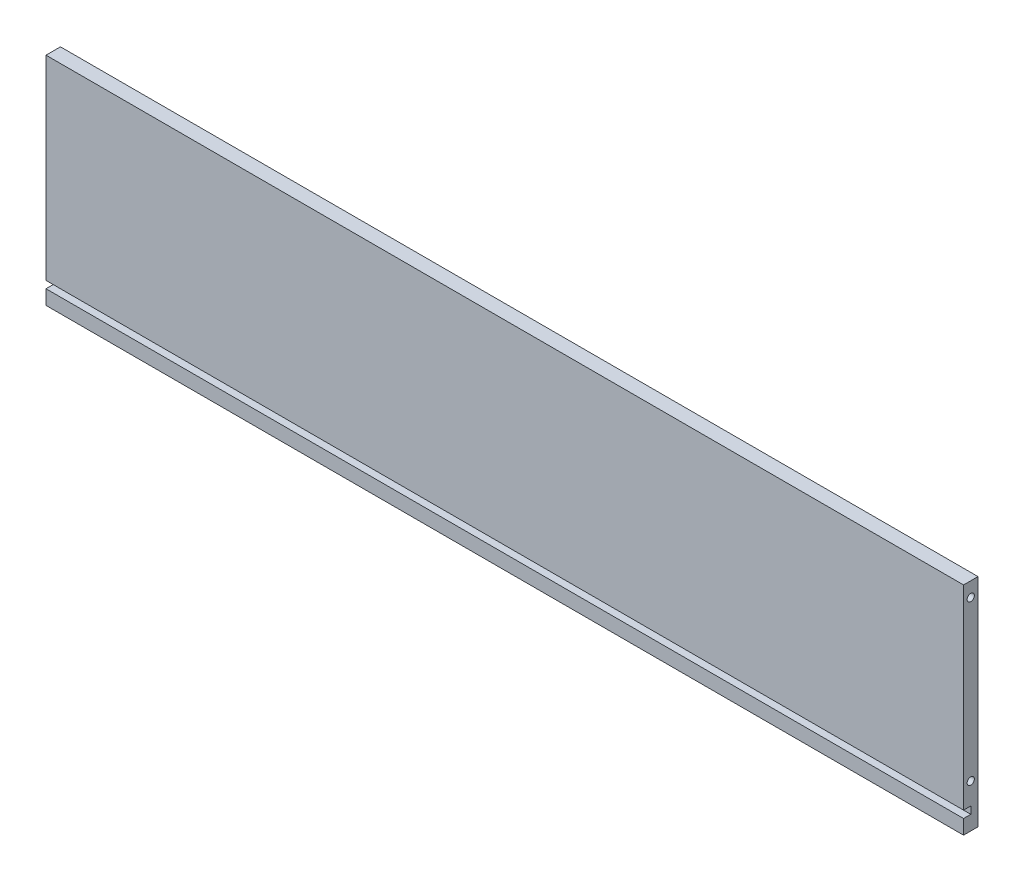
ISO-10303-21;
HEADER;
FILE_DESCRIPTION(('STEP AP214'),'2;1');
FILE_NAME('part.step','',(''),(''),'','','');
FILE_SCHEMA(('AUTOMOTIVE_DESIGN { 1 0 10303 214 1 1 1 1 }'));
ENDSEC;
DATA;
#1=APPLICATION_CONTEXT('core data for automotive mechanical design processes');
#2=APPLICATION_PROTOCOL_DEFINITION('international standard','automotive_design',2000,#1);
#3=PRODUCT_CONTEXT('',#1,'mechanical');
#4=PRODUCT('Part','Part','',(#3));
#5=PRODUCT_RELATED_PRODUCT_CATEGORY('part','',(#4));
#6=PRODUCT_DEFINITION_FORMATION('','',#4);
#7=PRODUCT_DEFINITION_CONTEXT('part definition',#1,'design');
#8=PRODUCT_DEFINITION('design','',#6,#7);
#9=PRODUCT_DEFINITION_SHAPE('','',#8);
#10=(LENGTH_UNIT() NAMED_UNIT(*) SI_UNIT(.MILLI.,.METRE.));
#11=(NAMED_UNIT(*) PLANE_ANGLE_UNIT() SI_UNIT($,.RADIAN.));
#12=(NAMED_UNIT(*) SI_UNIT($,.STERADIAN.) SOLID_ANGLE_UNIT());
#13=UNCERTAINTY_MEASURE_WITH_UNIT(LENGTH_MEASURE(1.E-05),#10,'distance_accuracy_value','');
#14=(GEOMETRIC_REPRESENTATION_CONTEXT(3) GLOBAL_UNCERTAINTY_ASSIGNED_CONTEXT((#13)) GLOBAL_UNIT_ASSIGNED_CONTEXT((#10,
#11,#12)) REPRESENTATION_CONTEXT('',''));
#15=CARTESIAN_POINT('',(0.,0.,0.));
#16=DIRECTION('',(0.,0.,1.));
#17=DIRECTION('',(1.,0.,0.));
#18=AXIS2_PLACEMENT_3D('',#15,#16,#17);
#19=CARTESIAN_POINT('',(-317.5,80.,10.));
#20=DIRECTION('',(0.,0.,-1.));
#21=DIRECTION('',(-1.,0.,0.));
#22=AXIS2_PLACEMENT_3D('',#19,#20,#21);
#23=PLANE('',#22);
#24=DIRECTION('',(0.,-1.,0.));
#25=VECTOR('',#24,1.);
#26=CARTESIAN_POINT('',(-317.5,-70.,10.));
#27=LINE('',#26,#25);
#28=CARTESIAN_POINT('',(-317.5,80.,10.));
#29=VERTEX_POINT('',#28);
#30=CARTESIAN_POINT('',(-317.5,-55.,10.));
#31=VERTEX_POINT('',#30);
#32=EDGE_CURVE('E170',#29,#31,#27,.T.);
#33=ORIENTED_EDGE('',*,*,#32,.T.);
#34=DIRECTION('',(1.,0.,0.));
#35=VECTOR('',#34,1.);
#36=CARTESIAN_POINT('',(-317.5,-55.,10.));
#37=LINE('',#36,#35);
#38=CARTESIAN_POINT('',(317.5,-55.,10.));
#39=VERTEX_POINT('',#38);
#40=EDGE_CURVE('E152',#31,#39,#37,.T.);
#41=ORIENTED_EDGE('',*,*,#40,.T.);
#42=DIRECTION('',(0.,1.,0.));
#43=VECTOR('',#42,1.);
#44=CARTESIAN_POINT('',(317.5,-70.,10.));
#45=LINE('',#44,#43);
#46=CARTESIAN_POINT('',(317.5,80.,10.));
#47=VERTEX_POINT('',#46);
#48=EDGE_CURVE('E174',#39,#47,#45,.T.);
#49=ORIENTED_EDGE('',*,*,#48,.T.);
#50=DIRECTION('',(-1.,0.,0.));
#51=VECTOR('',#50,1.);
#52=CARTESIAN_POINT('',(-317.5,80.,10.));
#53=LINE('',#52,#51);
#54=EDGE_CURVE('E51',#47,#29,#53,.T.);
#55=ORIENTED_EDGE('',*,*,#54,.T.);
#56=EDGE_LOOP('',(#33,#41,#49,#55));
#57=FACE_BOUND('',#56,.T.);
#58=ADVANCED_FACE('F28',(#57),#23,.F.);
#59=CARTESIAN_POINT('',(-317.5,-70.,10.));
#60=DIRECTION('',(1.,0.,0.));
#61=DIRECTION('',(0.,0.,-1.));
#62=AXIS2_PLACEMENT_3D('',#59,#60,#61);
#63=PLANE('',#62);
#64=CARTESIAN_POINT('',(-317.5,70.,4.99999999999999));
#65=DIRECTION('',(-1.,0.,0.));
#66=DIRECTION('',(0.,0.,1.));
#67=AXIS2_PLACEMENT_3D('',#64,#65,#66);
#68=CIRCLE('',#67,2.49999999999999);
#69=CARTESIAN_POINT('',(-317.5,70.,7.49999999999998));
#70=VERTEX_POINT('',#69);
#71=EDGE_CURVE('E113',#70,#70,#68,.T.);
#72=ORIENTED_EDGE('',*,*,#71,.F.);
#73=EDGE_LOOP('',(#72));
#74=FACE_BOUND('',#73,.T.);
#75=CARTESIAN_POINT('',(-317.5,-40.,4.99999999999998));
#76=DIRECTION('',(-1.,0.,0.));
#77=DIRECTION('',(0.,0.,1.));
#78=AXIS2_PLACEMENT_3D('',#75,#76,#77);
#79=CIRCLE('',#78,2.49999999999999);
#80=CARTESIAN_POINT('',(-317.5,-40.,7.49999999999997));
#81=VERTEX_POINT('',#80);
#82=EDGE_CURVE('E121',#81,#81,#79,.T.);
#83=ORIENTED_EDGE('',*,*,#82,.F.);
#84=EDGE_LOOP('',(#83));
#85=FACE_BOUND('',#84,.T.);
#86=DIRECTION('',(0.,1.,0.));
#87=VECTOR('',#86,1.);
#88=CARTESIAN_POINT('',(-317.5,-60.,5.));
#89=LINE('',#88,#87);
#90=CARTESIAN_POINT('',(-317.5,-60.,5.));
#91=VERTEX_POINT('',#90);
#92=CARTESIAN_POINT('',(-317.5,-55.,5.));
#93=VERTEX_POINT('',#92);
#94=EDGE_CURVE('E145',#91,#93,#89,.T.);
#95=ORIENTED_EDGE('',*,*,#94,.T.);
#96=DIRECTION('',(0.,0.,1.));
#97=VECTOR('',#96,1.);
#98=CARTESIAN_POINT('',(-317.5,-55.,10.));
#99=LINE('',#98,#97);
#100=EDGE_CURVE('E148',#93,#31,#99,.T.);
#101=ORIENTED_EDGE('',*,*,#100,.T.);
#102=ORIENTED_EDGE('',*,*,#32,.F.);
#103=DIRECTION('',(0.,0.,-1.));
#104=VECTOR('',#103,1.);
#105=CARTESIAN_POINT('',(-317.5,80.,10.));
#106=LINE('',#105,#104);
#107=CARTESIAN_POINT('',(-317.5,80.,0.));
#108=VERTEX_POINT('',#107);
#109=EDGE_CURVE('E179',#29,#108,#106,.T.);
#110=ORIENTED_EDGE('',*,*,#109,.T.);
#111=DIRECTION('',(0.,-1.,0.));
#112=VECTOR('',#111,1.);
#113=CARTESIAN_POINT('',(-317.5,-70.,0.));
#114=LINE('',#113,#112);
#115=CARTESIAN_POINT('',(-317.5,-70.,0.));
#116=VERTEX_POINT('',#115);
#117=EDGE_CURVE('E155',#108,#116,#114,.T.);
#118=ORIENTED_EDGE('',*,*,#117,.T.);
#119=DIRECTION('',(0.,0.,-1.));
#120=VECTOR('',#119,1.);
#121=CARTESIAN_POINT('',(-317.5,-70.,10.));
#122=LINE('',#121,#120);
#123=CARTESIAN_POINT('',(-317.5,-70.,10.));
#124=VERTEX_POINT('',#123);
#125=EDGE_CURVE('E11',#124,#116,#122,.T.);
#126=ORIENTED_EDGE('',*,*,#125,.F.);
#127=CARTESIAN_POINT('',(-317.5,-60.,10.));
#128=VERTEX_POINT('',#127);
#129=EDGE_CURVE('E169',#128,#124,#27,.T.);
#130=ORIENTED_EDGE('',*,*,#129,.F.);
#131=DIRECTION('',(0.,0.,-1.));
#132=VECTOR('',#131,1.);
#133=CARTESIAN_POINT('',(-317.5,-60.,10.));
#134=LINE('',#133,#132);
#135=EDGE_CURVE('E43',#128,#91,#134,.T.);
#136=ORIENTED_EDGE('',*,*,#135,.T.);
#137=EDGE_LOOP('',(#95,#101,#102,#110,#118,#126,#130,#136));
#138=FACE_BOUND('',#137,.T.);
#139=ADVANCED_FACE('F30',(#74,#85,#138),#63,.F.);
#140=CARTESIAN_POINT('',(-317.5,-70.,10.));
#141=DIRECTION('',(0.,1.,0.));
#142=DIRECTION('',(0.,0.,1.));
#143=AXIS2_PLACEMENT_3D('',#140,#141,#142);
#144=PLANE('',#143);
#145=DIRECTION('',(1.,0.,0.));
#146=VECTOR('',#145,1.);
#147=CARTESIAN_POINT('',(-317.5,-70.,0.));
#148=LINE('',#147,#146);
#149=CARTESIAN_POINT('',(317.5,-70.,0.));
#150=VERTEX_POINT('',#149);
#151=EDGE_CURVE('E163',#116,#150,#148,.T.);
#152=ORIENTED_EDGE('',*,*,#151,.T.);
#153=DIRECTION('',(0.,0.,-1.));
#154=VECTOR('',#153,1.);
#155=CARTESIAN_POINT('',(317.5,-70.,10.));
#156=LINE('',#155,#154);
#157=CARTESIAN_POINT('',(317.5,-70.,10.));
#158=VERTEX_POINT('',#157);
#159=EDGE_CURVE('E36',#158,#150,#156,.T.);
#160=ORIENTED_EDGE('',*,*,#159,.F.);
#161=DIRECTION('',(1.,0.,0.));
#162=VECTOR('',#161,1.);
#163=CARTESIAN_POINT('',(-317.5,-70.,10.));
#164=LINE('',#163,#162);
#165=EDGE_CURVE('E172',#124,#158,#164,.T.);
#166=ORIENTED_EDGE('',*,*,#165,.F.);
#167=ORIENTED_EDGE('',*,*,#125,.T.);
#168=EDGE_LOOP('',(#152,#160,#166,#167));
#169=FACE_BOUND('',#168,.T.);
#170=ADVANCED_FACE('F216',(#169),#144,.F.);
#171=CARTESIAN_POINT('',(317.5,-70.,10.));
#172=DIRECTION('',(-1.,0.,0.));
#173=DIRECTION('',(0.,0.,1.));
#174=AXIS2_PLACEMENT_3D('',#171,#172,#173);
#175=PLANE('',#174);
#176=CARTESIAN_POINT('',(317.5,70.,4.99999999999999));
#177=DIRECTION('',(1.,0.,0.));
#178=DIRECTION('',(0.,0.,-1.));
#179=AXIS2_PLACEMENT_3D('',#176,#177,#178);
#180=CIRCLE('',#179,2.49999999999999);
#181=CARTESIAN_POINT('',(317.5,70.,2.50000000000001));
#182=VERTEX_POINT('',#181);
#183=EDGE_CURVE('E127',#182,#182,#180,.T.);
#184=ORIENTED_EDGE('',*,*,#183,.F.);
#185=EDGE_LOOP('',(#184));
#186=FACE_BOUND('',#185,.T.);
#187=CARTESIAN_POINT('',(317.5,-40.,4.99999999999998));
#188=DIRECTION('',(1.,0.,0.));
#189=DIRECTION('',(0.,0.,-1.));
#190=AXIS2_PLACEMENT_3D('',#187,#188,#189);
#191=CIRCLE('',#190,2.49999999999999);
#192=CARTESIAN_POINT('',(317.5,-40.,2.49999999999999));
#193=VERTEX_POINT('',#192);
#194=EDGE_CURVE('E133',#193,#193,#191,.T.);
#195=ORIENTED_EDGE('',*,*,#194,.F.);
#196=EDGE_LOOP('',(#195));
#197=FACE_BOUND('',#196,.T.);
#198=ORIENTED_EDGE('',*,*,#48,.F.);
#199=DIRECTION('',(0.,0.,1.));
#200=VECTOR('',#199,1.);
#201=CARTESIAN_POINT('',(317.5,-55.,10.));
#202=LINE('',#201,#200);
#203=CARTESIAN_POINT('',(317.5,-55.,5.));
#204=VERTEX_POINT('',#203);
#205=EDGE_CURVE('E142',#204,#39,#202,.T.);
#206=ORIENTED_EDGE('',*,*,#205,.F.);
#207=DIRECTION('',(0.,1.,0.));
#208=VECTOR('',#207,1.);
#209=CARTESIAN_POINT('',(317.5,-60.,5.));
#210=LINE('',#209,#208);
#211=CARTESIAN_POINT('',(317.5,-60.,5.));
#212=VERTEX_POINT('',#211);
#213=EDGE_CURVE('E139',#212,#204,#210,.T.);
#214=ORIENTED_EDGE('',*,*,#213,.F.);
#215=DIRECTION('',(0.,0.,-1.));
#216=VECTOR('',#215,1.);
#217=CARTESIAN_POINT('',(317.5,-60.,10.));
#218=LINE('',#217,#216);
#219=CARTESIAN_POINT('',(317.5,-60.,10.));
#220=VERTEX_POINT('',#219);
#221=EDGE_CURVE('E136',#220,#212,#218,.T.);
#222=ORIENTED_EDGE('',*,*,#221,.F.);
#223=EDGE_CURVE('E175',#158,#220,#45,.T.);
#224=ORIENTED_EDGE('',*,*,#223,.F.);
#225=ORIENTED_EDGE('',*,*,#159,.T.);
#226=DIRECTION('',(0.,1.,0.));
#227=VECTOR('',#226,1.);
#228=CARTESIAN_POINT('',(317.5,-70.,0.));
#229=LINE('',#228,#227);
#230=CARTESIAN_POINT('',(317.5,80.,0.));
#231=VERTEX_POINT('',#230);
#232=EDGE_CURVE('E165',#150,#231,#229,.T.);
#233=ORIENTED_EDGE('',*,*,#232,.T.);
#234=DIRECTION('',(0.,0.,-1.));
#235=VECTOR('',#234,1.);
#236=CARTESIAN_POINT('',(317.5,80.,10.));
#237=LINE('',#236,#235);
#238=EDGE_CURVE('E182',#47,#231,#237,.T.);
#239=ORIENTED_EDGE('',*,*,#238,.F.);
#240=EDGE_LOOP('',(#198,#206,#214,#222,#224,#225,#233,#239));
#241=FACE_BOUND('',#240,.T.);
#242=ADVANCED_FACE('F190',(#186,#197,#241),#175,.F.);
#243=CARTESIAN_POINT('',(-317.5,80.,10.));
#244=DIRECTION('',(0.,-1.,0.));
#245=DIRECTION('',(0.,0.,-1.));
#246=AXIS2_PLACEMENT_3D('',#243,#244,#245);
#247=PLANE('',#246);
#248=DIRECTION('',(-1.,0.,0.));
#249=VECTOR('',#248,1.);
#250=CARTESIAN_POINT('',(-317.5,80.,0.));
#251=LINE('',#250,#249);
#252=EDGE_CURVE('E167',#231,#108,#251,.T.);
#253=ORIENTED_EDGE('',*,*,#252,.T.);
#254=ORIENTED_EDGE('',*,*,#109,.F.);
#255=ORIENTED_EDGE('',*,*,#54,.F.);
#256=ORIENTED_EDGE('',*,*,#238,.T.);
#257=EDGE_LOOP('',(#253,#254,#255,#256));
#258=FACE_BOUND('',#257,.T.);
#259=ADVANCED_FACE('F200',(#258),#247,.F.);
#260=ORIENTED_EDGE('',*,*,#223,.T.);
#261=DIRECTION('',(1.,0.,0.));
#262=VECTOR('',#261,1.);
#263=CARTESIAN_POINT('',(-317.5,-60.,10.));
#264=LINE('',#263,#262);
#265=EDGE_CURVE('E151',#128,#220,#264,.T.);
#266=ORIENTED_EDGE('',*,*,#265,.F.);
#267=ORIENTED_EDGE('',*,*,#129,.T.);
#268=ORIENTED_EDGE('',*,*,#165,.T.);
#269=EDGE_LOOP('',(#260,#266,#267,#268));
#270=FACE_BOUND('',#269,.T.);
#271=ADVANCED_FACE('F214',(#270),#23,.F.);
#272=CARTESIAN_POINT('',(-317.5,80.,0.));
#273=DIRECTION('',(0.,0.,-1.));
#274=DIRECTION('',(-1.,0.,0.));
#275=AXIS2_PLACEMENT_3D('',#272,#273,#274);
#276=PLANE('',#275);
#277=ORIENTED_EDGE('',*,*,#117,.F.);
#278=ORIENTED_EDGE('',*,*,#252,.F.);
#279=ORIENTED_EDGE('',*,*,#232,.F.);
#280=ORIENTED_EDGE('',*,*,#151,.F.);
#281=EDGE_LOOP('',(#277,#278,#279,#280));
#282=FACE_BOUND('',#281,.T.);
#283=ADVANCED_FACE('F198',(#282),#276,.T.);
#284=CARTESIAN_POINT('',(-317.5,-55.,10.));
#285=DIRECTION('',(0.,1.,0.));
#286=DIRECTION('',(0.,0.,1.));
#287=AXIS2_PLACEMENT_3D('',#284,#285,#286);
#288=PLANE('',#287);
#289=ORIENTED_EDGE('',*,*,#205,.T.);
#290=ORIENTED_EDGE('',*,*,#40,.F.);
#291=ORIENTED_EDGE('',*,*,#100,.F.);
#292=DIRECTION('',(1.,0.,0.));
#293=VECTOR('',#292,1.);
#294=CARTESIAN_POINT('',(-317.5,-55.,5.));
#295=LINE('',#294,#293);
#296=EDGE_CURVE('E156',#93,#204,#295,.T.);
#297=ORIENTED_EDGE('',*,*,#296,.T.);
#298=EDGE_LOOP('',(#289,#290,#291,#297));
#299=FACE_BOUND('',#298,.T.);
#300=ADVANCED_FACE('F208',(#299),#288,.F.);
#301=CARTESIAN_POINT('',(-317.5,-60.,5.));
#302=DIRECTION('',(0.,0.,-1.));
#303=DIRECTION('',(-1.,0.,0.));
#304=AXIS2_PLACEMENT_3D('',#301,#302,#303);
#305=PLANE('',#304);
#306=ORIENTED_EDGE('',*,*,#213,.T.);
#307=ORIENTED_EDGE('',*,*,#296,.F.);
#308=ORIENTED_EDGE('',*,*,#94,.F.);
#309=DIRECTION('',(1.,0.,0.));
#310=VECTOR('',#309,1.);
#311=CARTESIAN_POINT('',(-317.5,-60.,5.));
#312=LINE('',#311,#310);
#313=EDGE_CURVE('E158',#91,#212,#312,.T.);
#314=ORIENTED_EDGE('',*,*,#313,.T.);
#315=EDGE_LOOP('',(#306,#307,#308,#314));
#316=FACE_BOUND('',#315,.T.);
#317=ADVANCED_FACE('F211',(#316),#305,.F.);
#318=CARTESIAN_POINT('',(-317.5,-60.,10.));
#319=DIRECTION('',(0.,-1.,0.));
#320=DIRECTION('',(0.,0.,-1.));
#321=AXIS2_PLACEMENT_3D('',#318,#319,#320);
#322=PLANE('',#321);
#323=ORIENTED_EDGE('',*,*,#221,.T.);
#324=ORIENTED_EDGE('',*,*,#313,.F.);
#325=ORIENTED_EDGE('',*,*,#135,.F.);
#326=ORIENTED_EDGE('',*,*,#265,.T.);
#327=EDGE_LOOP('',(#323,#324,#325,#326));
#328=FACE_BOUND('',#327,.T.);
#329=ADVANCED_FACE('F212',(#328),#322,.F.);
#330=CARTESIAN_POINT('',(317.5,-40.,4.99999999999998));
#331=DIRECTION('',(1.,0.,0.));
#332=DIRECTION('',(0.,0.,-1.));
#333=AXIS2_PLACEMENT_3D('',#330,#331,#332);
#334=CYLINDRICAL_SURFACE('',#333,2.49999999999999);
#335=CARTESIAN_POINT('',(302.5,-40.,4.99999999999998));
#336=DIRECTION('',(1.,0.,0.));
#337=DIRECTION('',(0.,0.,-1.));
#338=AXIS2_PLACEMENT_3D('',#335,#336,#337);
#339=CIRCLE('',#338,2.5);
#340=CARTESIAN_POINT('',(302.5,-40.,2.49999999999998));
#341=VERTEX_POINT('',#340);
#342=EDGE_CURVE('E130',#341,#341,#339,.T.);
#343=ORIENTED_EDGE('',*,*,#342,.F.);
#344=EDGE_LOOP('',(#343));
#345=FACE_BOUND('',#344,.T.);
#346=ORIENTED_EDGE('',*,*,#194,.T.);
#347=EDGE_LOOP('',(#346));
#348=FACE_BOUND('',#347,.T.);
#349=ADVANCED_FACE('F266',(#345,#348),#334,.F.);
#350=CARTESIAN_POINT('',(302.5,-40.,4.99999999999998));
#351=DIRECTION('',(1.,0.,0.));
#352=DIRECTION('',(0.,0.,-1.));
#353=AXIS2_PLACEMENT_3D('',#350,#351,#352);
#354=CONICAL_SURFACE('',#353,2.5,1.02974425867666);
#355=CARTESIAN_POINT('',(300.997848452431,-40.,4.99999999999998));
#356=VERTEX_POINT('',#355);
#357=VERTEX_LOOP('',#356);
#358=FACE_BOUND('',#357,.T.);
#359=ORIENTED_EDGE('',*,*,#342,.T.);
#360=EDGE_LOOP('',(#359));
#361=FACE_BOUND('',#360,.T.);
#362=ADVANCED_FACE('F273',(#358,#361),#354,.F.);
#363=CARTESIAN_POINT('',(317.5,70.,4.99999999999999));
#364=DIRECTION('',(1.,0.,0.));
#365=DIRECTION('',(0.,0.,-1.));
#366=AXIS2_PLACEMENT_3D('',#363,#364,#365);
#367=CYLINDRICAL_SURFACE('',#366,2.5);
#368=CARTESIAN_POINT('',(302.5,70.,4.99999999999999));
#369=DIRECTION('',(1.,0.,0.));
#370=DIRECTION('',(0.,0.,-1.));
#371=AXIS2_PLACEMENT_3D('',#368,#369,#370);
#372=CIRCLE('',#371,2.5);
#373=CARTESIAN_POINT('',(302.5,70.,2.49999999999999));
#374=VERTEX_POINT('',#373);
#375=EDGE_CURVE('E124',#374,#374,#372,.T.);
#376=ORIENTED_EDGE('',*,*,#375,.F.);
#377=EDGE_LOOP('',(#376));
#378=FACE_BOUND('',#377,.T.);
#379=ORIENTED_EDGE('',*,*,#183,.T.);
#380=EDGE_LOOP('',(#379));
#381=FACE_BOUND('',#380,.T.);
#382=ADVANCED_FACE('F281',(#378,#381),#367,.F.);
#383=CARTESIAN_POINT('',(302.5,70.,4.99999999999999));
#384=DIRECTION('',(1.,0.,0.));
#385=DIRECTION('',(0.,0.,-1.));
#386=AXIS2_PLACEMENT_3D('',#383,#384,#385);
#387=CONICAL_SURFACE('',#386,2.5,1.02974425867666);
#388=CARTESIAN_POINT('',(300.997848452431,70.,4.99999999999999));
#389=VERTEX_POINT('',#388);
#390=VERTEX_LOOP('',#389);
#391=FACE_BOUND('',#390,.T.);
#392=ORIENTED_EDGE('',*,*,#375,.T.);
#393=EDGE_LOOP('',(#392));
#394=FACE_BOUND('',#393,.T.);
#395=ADVANCED_FACE('F289',(#391,#394),#387,.F.);
#396=CARTESIAN_POINT('',(-317.5,-40.,4.99999999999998));
#397=DIRECTION('',(-1.,0.,0.));
#398=DIRECTION('',(0.,0.,1.));
#399=AXIS2_PLACEMENT_3D('',#396,#397,#398);
#400=CYLINDRICAL_SURFACE('',#399,2.49999999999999);
#401=CARTESIAN_POINT('',(-302.5,-40.,4.99999999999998));
#402=DIRECTION('',(-1.,0.,0.));
#403=DIRECTION('',(0.,0.,1.));
#404=AXIS2_PLACEMENT_3D('',#401,#402,#403);
#405=CIRCLE('',#404,2.5);
#406=CARTESIAN_POINT('',(-302.5,-40.,7.49999999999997));
#407=VERTEX_POINT('',#406);
#408=EDGE_CURVE('E116',#407,#407,#405,.T.);
#409=ORIENTED_EDGE('',*,*,#408,.F.);
#410=EDGE_LOOP('',(#409));
#411=FACE_BOUND('',#410,.T.);
#412=ORIENTED_EDGE('',*,*,#82,.T.);
#413=EDGE_LOOP('',(#412));
#414=FACE_BOUND('',#413,.T.);
#415=ADVANCED_FACE('F297',(#411,#414),#400,.F.);
#416=CARTESIAN_POINT('',(-302.5,-40.,4.99999999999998));
#417=DIRECTION('',(-1.,0.,0.));
#418=DIRECTION('',(0.,0.,1.));
#419=AXIS2_PLACEMENT_3D('',#416,#417,#418);
#420=CONICAL_SURFACE('',#419,2.5,1.02974425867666);
#421=CARTESIAN_POINT('',(-300.997848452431,-40.,4.99999999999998));
#422=VERTEX_POINT('',#421);
#423=VERTEX_LOOP('',#422);
#424=FACE_BOUND('',#423,.T.);
#425=ORIENTED_EDGE('',*,*,#408,.T.);
#426=EDGE_LOOP('',(#425));
#427=FACE_BOUND('',#426,.T.);
#428=ADVANCED_FACE('F305',(#424,#427),#420,.F.);
#429=CARTESIAN_POINT('',(-317.5,70.,4.99999999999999));
#430=DIRECTION('',(-1.,0.,0.));
#431=DIRECTION('',(0.,0.,1.));
#432=AXIS2_PLACEMENT_3D('',#429,#430,#431);
#433=CYLINDRICAL_SURFACE('',#432,2.5);
#434=CARTESIAN_POINT('',(-302.5,70.,4.99999999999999));
#435=DIRECTION('',(-1.,0.,0.));
#436=DIRECTION('',(0.,0.,1.));
#437=AXIS2_PLACEMENT_3D('',#434,#435,#436);
#438=CIRCLE('',#437,2.5);
#439=CARTESIAN_POINT('',(-302.5,70.,7.5));
#440=VERTEX_POINT('',#439);
#441=EDGE_CURVE('E111',#440,#440,#438,.T.);
#442=ORIENTED_EDGE('',*,*,#441,.F.);
#443=EDGE_LOOP('',(#442));
#444=FACE_BOUND('',#443,.T.);
#445=ORIENTED_EDGE('',*,*,#71,.T.);
#446=EDGE_LOOP('',(#445));
#447=FACE_BOUND('',#446,.T.);
#448=ADVANCED_FACE('F107',(#444,#447),#433,.F.);
#449=CARTESIAN_POINT('',(-302.5,70.,4.99999999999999));
#450=DIRECTION('',(-1.,0.,0.));
#451=DIRECTION('',(0.,0.,1.));
#452=AXIS2_PLACEMENT_3D('',#449,#450,#451);
#453=CONICAL_SURFACE('',#452,2.5,1.02974425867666);
#454=CARTESIAN_POINT('',(-300.997848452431,70.,4.99999999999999));
#455=VERTEX_POINT('',#454);
#456=VERTEX_LOOP('',#455);
#457=FACE_BOUND('',#456,.T.);
#458=ORIENTED_EDGE('',*,*,#441,.T.);
#459=EDGE_LOOP('',(#458));
#460=FACE_BOUND('',#459,.T.);
#461=ADVANCED_FACE('F104',(#457,#460),#453,.F.);
#462=CLOSED_SHELL('',(#58,#139,#170,#242,#259,#271,#283,#300,#317,#329,#349,#362,#382,#395,#415,
#428,#448,#461));
#463=MANIFOLD_SOLID_BREP('B2',#462);
#464=ADVANCED_BREP_SHAPE_REPRESENTATION('',(#18,#463),#14);
#465=SHAPE_DEFINITION_REPRESENTATION(#9,#464);
ENDSEC;
END-ISO-10303-21;
